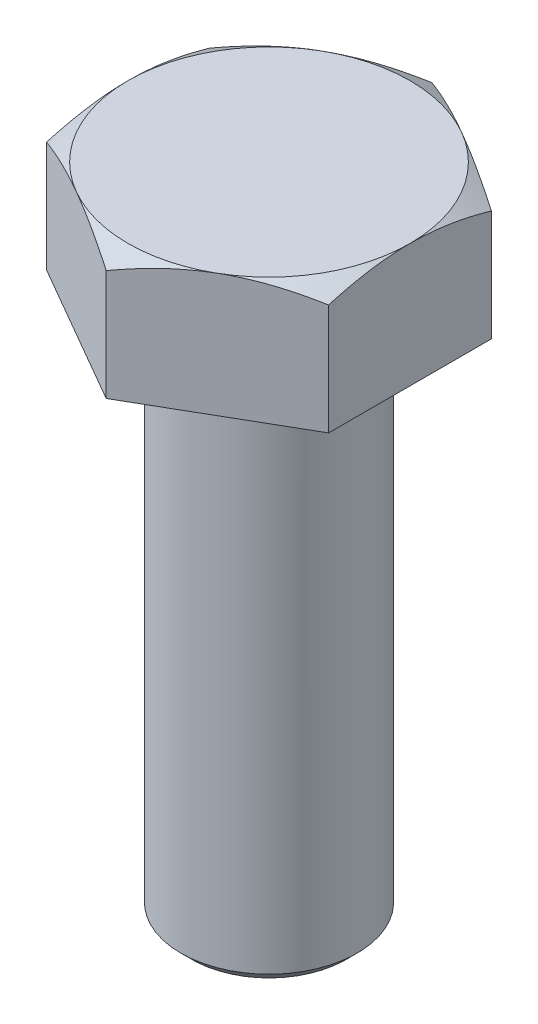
ISO-10303-21;
HEADER;
FILE_DESCRIPTION(('STEP AP214'),'2;1');
FILE_NAME('part.step','',(''),(''),'','','');
FILE_SCHEMA(('AUTOMOTIVE_DESIGN { 1 0 10303 214 1 1 1 1 }'));
ENDSEC;
DATA;
#1=APPLICATION_CONTEXT('core data for automotive mechanical design processes');
#2=APPLICATION_PROTOCOL_DEFINITION('international standard','automotive_design',2000,#1);
#3=PRODUCT_CONTEXT('',#1,'mechanical');
#4=PRODUCT('Part','Part','',(#3));
#5=PRODUCT_RELATED_PRODUCT_CATEGORY('part','',(#4));
#6=PRODUCT_DEFINITION_FORMATION('','',#4);
#7=PRODUCT_DEFINITION_CONTEXT('part definition',#1,'design');
#8=PRODUCT_DEFINITION('design','',#6,#7);
#9=PRODUCT_DEFINITION_SHAPE('','',#8);
#10=(LENGTH_UNIT() NAMED_UNIT(*) SI_UNIT(.MILLI.,.METRE.));
#11=(NAMED_UNIT(*) PLANE_ANGLE_UNIT() SI_UNIT($,.RADIAN.));
#12=(NAMED_UNIT(*) SI_UNIT($,.STERADIAN.) SOLID_ANGLE_UNIT());
#13=UNCERTAINTY_MEASURE_WITH_UNIT(LENGTH_MEASURE(1.E-05),#10,'distance_accuracy_value','');
#14=(GEOMETRIC_REPRESENTATION_CONTEXT(3) GLOBAL_UNCERTAINTY_ASSIGNED_CONTEXT((#13)) GLOBAL_UNIT_ASSIGNED_CONTEXT((#10,
#11,#12)) REPRESENTATION_CONTEXT('',''));
#15=CARTESIAN_POINT('',(0.,0.,0.));
#16=DIRECTION('',(0.,0.,1.));
#17=DIRECTION('',(1.,0.,0.));
#18=AXIS2_PLACEMENT_3D('',#15,#16,#17);
#19=CARTESIAN_POINT('',(0.,-30.,0.));
#20=DIRECTION('',(0.,1.,0.));
#21=DIRECTION('',(0.,0.,1.));
#22=AXIS2_PLACEMENT_3D('',#19,#20,#21);
#23=CYLINDRICAL_SURFACE('',#22,5.);
#24=CARTESIAN_POINT('',(0.,0.,0.));
#25=DIRECTION('',(0.,1.,0.));
#26=DIRECTION('',(0.,0.,1.));
#27=AXIS2_PLACEMENT_3D('',#24,#25,#26);
#28=CIRCLE('',#27,5.);
#29=CARTESIAN_POINT('',(0.,0.,5.));
#30=VERTEX_POINT('',#29);
#31=EDGE_CURVE('E258',#30,#30,#28,.F.);
#32=ORIENTED_EDGE('',*,*,#31,.T.);
#33=EDGE_LOOP('',(#32));
#34=FACE_BOUND('',#33,.T.);
#35=CARTESIAN_POINT('',(0.,-29.375,0.));
#36=DIRECTION('',(0.,1.,0.));
#37=DIRECTION('',(0.,0.,1.));
#38=AXIS2_PLACEMENT_3D('',#35,#36,#37);
#39=CIRCLE('',#38,5.);
#40=CARTESIAN_POINT('',(0.,-29.375,5.));
#41=VERTEX_POINT('',#40);
#42=EDGE_CURVE('E348',#41,#41,#39,.F.);
#43=ORIENTED_EDGE('',*,*,#42,.F.);
#44=EDGE_LOOP('',(#43));
#45=FACE_BOUND('',#44,.T.);
#46=ADVANCED_FACE('F50',(#34,#45),#23,.T.);
#47=CARTESIAN_POINT('',(8.,7.,-4.61880215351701));
#48=DIRECTION('',(-0.5,0.,0.866025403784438));
#49=DIRECTION('',(0.866025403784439,0.,0.5));
#50=AXIS2_PLACEMENT_3D('',#47,#48,#49);
#51=PLANE('',#50);
#52=CARTESIAN_POINT('',(8.0002,6.28540215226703,-4.61868668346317));
#53=CARTESIAN_POINT('',(7.8243512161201,6.3440092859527,-4.7202130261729));
#54=CARTESIAN_POINT('',(7.64784680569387,6.39995659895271,-4.82211789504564));
#55=CARTESIAN_POINT('',(7.29340453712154,6.50579899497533,-5.02675523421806));
#56=CARTESIAN_POINT('',(7.11546609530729,6.55569146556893,-5.1294880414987));
#57=CARTESIAN_POINT('',(6.57880176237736,6.69530720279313,-5.43933133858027));
#58=CARTESIAN_POINT('',(6.21795741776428,6.77471882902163,-5.64766491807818));
#59=CARTESIAN_POINT('',(5.67796082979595,6.86783835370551,-5.95943209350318));
#60=CARTESIAN_POINT('',(5.50042181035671,6.89436541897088,-6.06193429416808));
#61=CARTESIAN_POINT('',(5.1445408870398,6.93884682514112,-6.26740224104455));
#62=CARTESIAN_POINT('',(4.96619905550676,6.95680192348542,-6.37036794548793));
#63=CARTESIAN_POINT('',(4.6092083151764,6.98368435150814,-6.57647664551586));
#64=CARTESIAN_POINT('',(4.4305599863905,6.99262192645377,-6.67961930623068));
#65=CARTESIAN_POINT('',(4.07309829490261,7.00127769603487,-6.88599991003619));
#66=CARTESIAN_POINT('',(3.89428493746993,7.00099617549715,-6.98923785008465));
#67=CARTESIAN_POINT('',(3.55998663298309,6.99185497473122,-7.18224506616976));
#68=CARTESIAN_POINT('',(3.40447809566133,6.98411039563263,-7.27202796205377));
#69=CARTESIAN_POINT('',(3.09382523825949,6.96179886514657,-7.45138347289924));
#70=CARTESIAN_POINT('',(2.93868094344,6.94723145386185,-7.54095607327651));
#71=CARTESIAN_POINT('',(2.47384868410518,6.89363930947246,-7.80932710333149));
#72=CARTESIAN_POINT('',(2.16498351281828,6.84473135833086,-7.98765049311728));
#73=CARTESIAN_POINT('',(1.5439767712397,6.72246059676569,-8.34618890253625));
#74=CARTESIAN_POINT('',(1.23191445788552,6.648579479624,-8.52635816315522));
#75=CARTESIAN_POINT('',(0.612443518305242,6.48089985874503,-8.88400987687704));
#76=CARTESIAN_POINT('',(0.30502695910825,6.38714073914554,-9.06149691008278));
#77=CARTESIAN_POINT('',(-0.000199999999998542,6.28540215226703,-9.23771977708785));
#78=B_SPLINE_CURVE_WITH_KNOTS('',3,(#52,#53,#54,#55,#56,#57,#58,#59,#60,#61,#62,#63,#64,#65,#66,
#67,#68,#69,#70,#71,#72,#73,#74,#75,#76,#77),.UNSPECIFIED.,.F.,.F.,(4,2,2,2,2,2,2,2,2,2,2,2,4),
(0.,0.633973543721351,1.26821965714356,2.53934712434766,3.15934343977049,3.77928496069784,
4.39852133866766,5.01773858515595,5.55680239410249,6.09590254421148,7.17487077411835,
8.27776850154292,9.37850115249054),.UNSPECIFIED.);
#79=CARTESIAN_POINT('',(8.,6.28546882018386,-4.61880215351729));
#80=VERTEX_POINT('',#79);
#81=CARTESIAN_POINT('',(4.,7.,-6.92820323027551));
#82=VERTEX_POINT('',#81);
#83=EDGE_CURVE('E121',#80,#82,#78,.T.);
#84=ORIENTED_EDGE('',*,*,#83,.F.);
#85=DIRECTION('',(0.,-1.,0.));
#86=VECTOR('',#85,1.);
#87=CARTESIAN_POINT('',(8.,7.,-4.61880215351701));
#88=LINE('',#87,#86);
#89=CARTESIAN_POINT('',(8.,0.,-4.61880215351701));
#90=VERTEX_POINT('',#89);
#91=EDGE_CURVE('E253',#80,#90,#88,.T.);
#92=ORIENTED_EDGE('',*,*,#91,.T.);
#93=DIRECTION('',(-0.866025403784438,0.,-0.5));
#94=VECTOR('',#93,1.);
#95=CARTESIAN_POINT('',(8.,0.,-4.61880215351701));
#96=LINE('',#95,#94);
#97=CARTESIAN_POINT('',(0.,0.,-9.23760430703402));
#98=VERTEX_POINT('',#97);
#99=EDGE_CURVE('E129',#90,#98,#96,.T.);
#100=ORIENTED_EDGE('',*,*,#99,.T.);
#101=DIRECTION('',(0.,-1.,0.));
#102=VECTOR('',#101,1.);
#103=CARTESIAN_POINT('',(0.,7.,-9.23760430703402));
#104=LINE('',#103,#102);
#105=CARTESIAN_POINT('',(0.,6.28546882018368,-9.23760430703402));
#106=VERTEX_POINT('',#105);
#107=EDGE_CURVE('E144',#106,#98,#104,.T.);
#108=ORIENTED_EDGE('',*,*,#107,.F.);
#109=EDGE_CURVE('E130',#82,#106,#78,.T.);
#110=ORIENTED_EDGE('',*,*,#109,.F.);
#111=EDGE_LOOP('',(#84,#92,#100,#108,#110));
#112=FACE_BOUND('',#111,.T.);
#113=ADVANCED_FACE('F52',(#112),#51,.F.);
#114=CARTESIAN_POINT('',(0.,7.,-9.23760430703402));
#115=DIRECTION('',(0.5,0.,0.866025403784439));
#116=DIRECTION('',(0.866025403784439,0.,-0.5));
#117=AXIS2_PLACEMENT_3D('',#114,#115,#116);
#118=PLANE('',#117);
#119=CARTESIAN_POINT('',(0.000200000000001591,6.28540215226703,-9.23771977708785));
#120=CARTESIAN_POINT('',(-0.175648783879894,6.3440092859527,-9.13619343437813));
#121=CARTESIAN_POINT('',(-0.352153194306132,6.39995659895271,-9.03428856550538));
#122=CARTESIAN_POINT('',(-0.706595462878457,6.50579899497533,-8.82965122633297));
#123=CARTESIAN_POINT('',(-0.884533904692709,6.55569146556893,-8.72691841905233));
#124=CARTESIAN_POINT('',(-1.42119823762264,6.69530720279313,-8.41707512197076));
#125=CARTESIAN_POINT('',(-1.78204258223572,6.77471882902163,-8.20874154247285));
#126=CARTESIAN_POINT('',(-2.32203917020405,6.86783835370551,-7.89697436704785));
#127=CARTESIAN_POINT('',(-2.49957818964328,6.89436541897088,-7.79447216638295));
#128=CARTESIAN_POINT('',(-2.8554591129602,6.93884682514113,-7.58900421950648));
#129=CARTESIAN_POINT('',(-3.03380094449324,6.95680192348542,-7.4860385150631));
#130=CARTESIAN_POINT('',(-3.3907916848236,6.98368435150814,-7.27992981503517));
#131=CARTESIAN_POINT('',(-3.5694400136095,6.99262192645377,-7.17678715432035));
#132=CARTESIAN_POINT('',(-3.92690170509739,7.00127769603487,-6.97040655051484));
#133=CARTESIAN_POINT('',(-4.10571506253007,7.00099617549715,-6.86716861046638));
#134=CARTESIAN_POINT('',(-4.44001336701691,6.99185497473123,-6.67416139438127));
#135=CARTESIAN_POINT('',(-4.59552190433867,6.98411039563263,-6.58437849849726));
#136=CARTESIAN_POINT('',(-4.90617476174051,6.96179886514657,-6.40502298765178));
#137=CARTESIAN_POINT('',(-5.06131905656,6.94723145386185,-6.31545038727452));
#138=CARTESIAN_POINT('',(-5.52615131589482,6.89363930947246,-6.04707935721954));
#139=CARTESIAN_POINT('',(-5.83501648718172,6.84473135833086,-5.86875596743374));
#140=CARTESIAN_POINT('',(-6.4560232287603,6.72246059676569,-5.51021755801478));
#141=CARTESIAN_POINT('',(-6.76808554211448,6.648579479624,-5.33004829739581));
#142=CARTESIAN_POINT('',(-7.38755648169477,6.48089985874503,-4.97239658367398));
#143=CARTESIAN_POINT('',(-7.69497304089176,6.38714073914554,-4.79490955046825));
#144=CARTESIAN_POINT('',(-8.00020000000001,6.28540215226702,-4.61868668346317));
#145=B_SPLINE_CURVE_WITH_KNOTS('',3,(#119,#120,#121,#122,#123,#124,#125,#126,#127,#128,#129,
#130,#131,#132,#133,#134,#135,#136,#137,#138,#139,#140,#141,#142,#143,#144),.UNSPECIFIED.,.F.,
.F.,(4,2,2,2,2,2,2,2,2,2,2,2,4),(0.,0.633973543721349,1.26821965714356,2.53934712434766,
3.15934343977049,3.77928496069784,4.39852133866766,5.01773858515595,5.55680239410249,
6.09590254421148,7.17487077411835,8.27776850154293,9.37850115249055),.UNSPECIFIED.);
#146=CARTESIAN_POINT('',(-4.,7.,-6.92820323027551));
#147=VERTEX_POINT('',#146);
#148=EDGE_CURVE('E136',#106,#147,#145,.T.);
#149=ORIENTED_EDGE('',*,*,#148,.F.);
#150=ORIENTED_EDGE('',*,*,#107,.T.);
#151=DIRECTION('',(-0.866025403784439,0.,0.5));
#152=VECTOR('',#151,1.);
#153=CARTESIAN_POINT('',(0.,0.,-9.23760430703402));
#154=LINE('',#153,#152);
#155=CARTESIAN_POINT('',(-8.00000000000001,0.,-4.61880215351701));
#156=VERTEX_POINT('',#155);
#157=EDGE_CURVE('E293',#98,#156,#154,.T.);
#158=ORIENTED_EDGE('',*,*,#157,.T.);
#159=DIRECTION('',(0.,-1.,0.));
#160=VECTOR('',#159,1.);
#161=CARTESIAN_POINT('',(-8.00000000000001,7.,-4.61880215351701));
#162=LINE('',#161,#160);
#163=CARTESIAN_POINT('',(-8.00000000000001,6.28546882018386,-4.61880215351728));
#164=VERTEX_POINT('',#163);
#165=EDGE_CURVE('E251',#164,#156,#162,.T.);
#166=ORIENTED_EDGE('',*,*,#165,.F.);
#167=EDGE_CURVE('E145',#147,#164,#145,.T.);
#168=ORIENTED_EDGE('',*,*,#167,.F.);
#169=EDGE_LOOP('',(#149,#150,#158,#166,#168));
#170=FACE_BOUND('',#169,.T.);
#171=ADVANCED_FACE('F199',(#170),#118,.F.);
#172=CARTESIAN_POINT('',(-8.00000000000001,7.,-4.61880215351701));
#173=DIRECTION('',(1.,0.,0.));
#174=DIRECTION('',(0.,0.,-1.));
#175=AXIS2_PLACEMENT_3D('',#172,#173,#174);
#176=PLANE('',#175);
#177=CARTESIAN_POINT('',(-8.00000000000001,2.98210147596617,-12.6403241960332));
#178=CARTESIAN_POINT('',(-8.00000000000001,3.15352784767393,-12.288843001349));
#179=CARTESIAN_POINT('',(-8.00000000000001,3.32337660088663,-11.9365795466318));
#180=CARTESIAN_POINT('',(-8.00000000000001,3.6590358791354,-11.2300728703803));
#181=CARTESIAN_POINT('',(-8.00000000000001,3.82484581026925,-10.8758293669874));
#182=CARTESIAN_POINT('',(-8.00000000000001,4.15232914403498,-10.1632322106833));
#183=CARTESIAN_POINT('',(-8.00000000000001,4.3139770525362,-9.8048668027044));
#184=CARTESIAN_POINT('',(-8.00000000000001,4.63096142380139,-9.08536584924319));
#185=CARTESIAN_POINT('',(-8.00000000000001,4.78629817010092,-8.72423042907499));
#186=CARTESIAN_POINT('',(-8.00000000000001,5.09418856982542,-7.98618087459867));
#187=CARTESIAN_POINT('',(-8.00000000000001,5.2464643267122,-7.60915019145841));
#188=CARTESIAN_POINT('',(-8.00000000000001,5.54004662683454,-6.85076602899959));
#189=CARTESIAN_POINT('',(-8.00000000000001,5.68135197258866,-6.46941208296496));
#190=CARTESIAN_POINT('',(-8.00000000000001,5.94945436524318,-5.70241102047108));
#191=CARTESIAN_POINT('',(-8.00000000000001,6.07627885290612,-5.31677359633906));
#192=CARTESIAN_POINT('',(-8.00000000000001,6.31150673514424,-4.53998544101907));
#193=CARTESIAN_POINT('',(-8.00000000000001,6.41991568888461,-4.1488364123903));
#194=CARTESIAN_POINT('',(-8.00000000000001,6.6126837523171,-3.36291309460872));
#195=CARTESIAN_POINT('',(-8.00000000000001,6.69717902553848,-2.96817310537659));
#196=CARTESIAN_POINT('',(-8.00000000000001,6.80244314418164,-2.372289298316));
#197=CARTESIAN_POINT('',(-8.00000000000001,6.83395269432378,-2.17301971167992));
#198=CARTESIAN_POINT('',(-8.00000000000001,6.88920069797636,-1.77341268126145));
#199=CARTESIAN_POINT('',(-8.00000000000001,6.91293990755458,-1.57307534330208));
#200=CARTESIAN_POINT('',(-8.00000000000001,6.95186378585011,-1.1743200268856));
#201=CARTESIAN_POINT('',(-8.00000000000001,6.96716047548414,-0.975913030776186));
#202=CARTESIAN_POINT('',(-8.00000000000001,6.98934114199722,-0.578629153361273));
#203=CARTESIAN_POINT('',(-8.00000000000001,6.99622526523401,-0.379752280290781));
#204=CARTESIAN_POINT('',(-8.00000000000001,7.0014154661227,0.018116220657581));
#205=CARTESIAN_POINT('',(-8.,6.99972150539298,0.217107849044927));
#206=CARTESIAN_POINT('',(-8.,6.98779932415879,0.614837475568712));
#207=CARTESIAN_POINT('',(-8.,6.97757072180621,0.813575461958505));
#208=CARTESIAN_POINT('',(-8.,6.94346280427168,1.28422959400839));
#209=CARTESIAN_POINT('',(-8.,6.91592258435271,1.55588667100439));
#210=CARTESIAN_POINT('',(-8.,6.84634635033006,2.0973230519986));
#211=CARTESIAN_POINT('',(-8.,6.80430856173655,2.36710212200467));
#212=CARTESIAN_POINT('',(-8.,6.65866676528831,3.17322847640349));
#213=CARTESIAN_POINT('',(-8.,6.53555570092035,3.70610589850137));
#214=CARTESIAN_POINT('',(-8.,6.32026611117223,4.50338683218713));
#215=CARTESIAN_POINT('',(-8.,6.24232167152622,4.77187301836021));
#216=CARTESIAN_POINT('',(-8.,6.0778896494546,5.30624232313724));
#217=CARTESIAN_POINT('',(-8.,5.99140199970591,5.57212542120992));
#218=CARTESIAN_POINT('',(-8.,5.8113080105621,6.10136688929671));
#219=CARTESIAN_POINT('',(-8.,5.71770360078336,6.36472592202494));
#220=CARTESIAN_POINT('',(-8.,5.52452196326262,6.88922947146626));
#221=CARTESIAN_POINT('',(-8.,5.42494488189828,7.15037404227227));
#222=CARTESIAN_POINT('',(-8.,5.14514476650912,7.86355537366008));
#223=CARTESIAN_POINT('',(-8.,4.95985624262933,8.31360309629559));
#224=CARTESIAN_POINT('',(-8.,4.5781123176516,9.2089554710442));
#225=CARTESIAN_POINT('',(-8.,4.38165558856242,9.65425955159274));
#226=CARTESIAN_POINT('',(-8.,3.98026324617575,10.5412363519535));
#227=CARTESIAN_POINT('',(-8.,3.7753241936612,10.9829075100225));
#228=CARTESIAN_POINT('',(-8.,3.35903186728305,11.8631821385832));
#229=CARTESIAN_POINT('',(-8.,3.1476788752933,12.3017857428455));
#230=CARTESIAN_POINT('',(-8.,2.71961681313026,13.1772814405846));
#231=CARTESIAN_POINT('',(-8.,2.50289932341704,13.6141694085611));
#232=CARTESIAN_POINT('',(-8.,2.06550352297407,14.4859595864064));
#233=CARTESIAN_POINT('',(-8.,1.84482517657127,14.9208617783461));
#234=CARTESIAN_POINT('',(-8.,1.40034905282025,15.7889376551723));
#235=CARTESIAN_POINT('',(-8.,1.1765520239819,16.2221117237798));
#236=CARTESIAN_POINT('',(-8.,0.72637922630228,17.0871185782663));
#237=CARTESIAN_POINT('',(-8.,0.500003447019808,17.5189513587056));
#238=CARTESIAN_POINT('',(-8.,-0.132898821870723,18.71912958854));
#239=CARTESIAN_POINT('',(-8.,-0.541721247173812,19.4862640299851));
#240=CARTESIAN_POINT('',(-8.,-1.36422301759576,21.0179839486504));
#241=CARTESIAN_POINT('',(-8.,-1.7779026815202,21.782569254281));
#242=CARTESIAN_POINT('',(-8.,-2.60742602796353,23.3071112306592));
#243=CARTESIAN_POINT('',(-8.,-3.0232571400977,24.0670747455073));
#244=CARTESIAN_POINT('',(-8.,-3.6490471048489,25.2058550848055));
#245=CARTESIAN_POINT('',(-8.,-3.85797568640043,25.5852388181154));
#246=CARTESIAN_POINT('',(-8.,-4.27644296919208,26.3436690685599));
#247=CARTESIAN_POINT('',(-8.,-4.48598166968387,26.7227155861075));
#248=CARTESIAN_POINT('',(-8.,-4.69578739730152,27.1016142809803));
#249=B_SPLINE_CURVE_WITH_KNOTS('',3,(#177,#178,#179,#180,#181,#182,#183,#184,#185,#186,#187,
#188,#189,#190,#191,#192,#193,#194,#195,#196,#197,#198,#199,#200,#201,#202,#203,#204,#205,#206,
#207,#208,#209,#210,#211,#212,#213,#214,#215,#216,#217,#218,#219,#220,#221,#222,#223,#224,#225,
#226,#227,#228,#229,#230,#231,#232,#233,#234,#235,#236,#237,#238,#239,#240,#241,#242,#243,#244,
#245,#246,#247,#248),.UNSPECIFIED.,.F.,.F.,(4,2,2,2,2,2,2,2,2,2,2,2,2,2,2,2,2,2,2,2,2,2,2,2,2,2,
2,2,2,2,2,2,2,2,2,4),(0.,1.17318598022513,2.3465434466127,3.52590216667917,4.70520784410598,
5.92493599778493,7.14479710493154,8.36230684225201,9.57944838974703,10.789513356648,
11.3946221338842,11.9996720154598,12.5964878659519,13.1932933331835,13.7901014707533,
14.3869363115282,15.2056272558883,16.0244184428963,17.6627769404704,18.5014144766,
19.3400586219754,20.1784761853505,21.0168732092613,22.4767387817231,23.9367783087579,
25.3974157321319,26.8579890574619,28.3210217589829,29.7840676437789,31.2467682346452,
32.7094747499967,35.3172586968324,37.9252147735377,40.524079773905,41.8234055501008,
43.1227297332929),.UNSPECIFIED.);
#250=CARTESIAN_POINT('',(-8.,7.,0.));
#251=VERTEX_POINT('',#250);
#252=EDGE_CURVE('E193',#164,#251,#249,.T.);
#253=ORIENTED_EDGE('',*,*,#252,.F.);
#254=ORIENTED_EDGE('',*,*,#165,.T.);
#255=DIRECTION('',(0.,0.,1.));
#256=VECTOR('',#255,1.);
#257=CARTESIAN_POINT('',(-8.00000000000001,0.,-4.61880215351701));
#258=LINE('',#257,#256);
#259=CARTESIAN_POINT('',(-8.,0.,4.61880215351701));
#260=VERTEX_POINT('',#259);
#261=EDGE_CURVE('E292',#156,#260,#258,.T.);
#262=ORIENTED_EDGE('',*,*,#261,.T.);
#263=DIRECTION('',(0.,-1.,0.));
#264=VECTOR('',#263,1.);
#265=CARTESIAN_POINT('',(-8.,7.,4.61880215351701));
#266=LINE('',#265,#264);
#267=CARTESIAN_POINT('',(-8.,6.28546882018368,4.61880215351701));
#268=VERTEX_POINT('',#267);
#269=EDGE_CURVE('E248',#268,#260,#266,.T.);
#270=ORIENTED_EDGE('',*,*,#269,.F.);
#271=EDGE_CURVE('E188',#251,#268,#249,.T.);
#272=ORIENTED_EDGE('',*,*,#271,.F.);
#273=EDGE_LOOP('',(#253,#254,#262,#270,#272));
#274=FACE_BOUND('',#273,.T.);
#275=ADVANCED_FACE('F195',(#274),#176,.F.);
#276=CARTESIAN_POINT('',(-8.,7.,4.61880215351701));
#277=DIRECTION('',(0.5,0.,-0.866025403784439));
#278=DIRECTION('',(-0.866025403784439,0.,-0.5));
#279=AXIS2_PLACEMENT_3D('',#276,#277,#278);
#280=PLANE('',#279);
#281=CARTESIAN_POINT('',(-8.0002,6.28540215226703,4.61868668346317));
#282=CARTESIAN_POINT('',(-7.82435121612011,6.3440092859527,4.7202130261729));
#283=CARTESIAN_POINT('',(-7.64784680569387,6.39995659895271,4.82211789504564));
#284=CARTESIAN_POINT('',(-7.29340453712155,6.50579899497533,5.02675523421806));
#285=CARTESIAN_POINT('',(-7.11546609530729,6.55569146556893,5.1294880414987));
#286=CARTESIAN_POINT('',(-6.57880176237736,6.69530720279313,5.43933133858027));
#287=CARTESIAN_POINT('',(-6.21795741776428,6.77471882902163,5.64766491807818));
#288=CARTESIAN_POINT('',(-5.67796082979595,6.86783835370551,5.95943209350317));
#289=CARTESIAN_POINT('',(-5.50042181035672,6.89436541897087,6.06193429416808));
#290=CARTESIAN_POINT('',(-5.1445408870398,6.93884682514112,6.26740224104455));
#291=CARTESIAN_POINT('',(-4.96619905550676,6.95680192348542,6.37036794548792));
#292=CARTESIAN_POINT('',(-4.60920831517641,6.98368435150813,6.57647664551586));
#293=CARTESIAN_POINT('',(-4.4305599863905,6.99262192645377,6.67961930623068));
#294=CARTESIAN_POINT('',(-4.07309829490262,7.00127769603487,6.88599991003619));
#295=CARTESIAN_POINT('',(-3.89428493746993,7.00099617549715,6.98923785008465));
#296=CARTESIAN_POINT('',(-3.5599866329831,6.99185497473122,7.18224506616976));
#297=CARTESIAN_POINT('',(-3.40447809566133,6.98411039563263,7.27202796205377));
#298=CARTESIAN_POINT('',(-3.09382523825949,6.96179886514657,7.45138347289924));
#299=CARTESIAN_POINT('',(-2.93868094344,6.94723145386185,7.54095607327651));
#300=CARTESIAN_POINT('',(-2.47384868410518,6.89363930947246,7.80932710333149));
#301=CARTESIAN_POINT('',(-2.16498351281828,6.84473135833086,7.98765049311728));
#302=CARTESIAN_POINT('',(-1.5439767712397,6.72246059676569,8.34618890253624));
#303=CARTESIAN_POINT('',(-1.23191445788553,6.648579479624,8.52635816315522));
#304=CARTESIAN_POINT('',(-0.612443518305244,6.48089985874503,8.88400987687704));
#305=CARTESIAN_POINT('',(-0.305026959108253,6.38714073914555,9.06149691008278));
#306=CARTESIAN_POINT('',(0.000199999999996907,6.28540215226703,9.23771977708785));
#307=B_SPLINE_CURVE_WITH_KNOTS('',3,(#281,#282,#283,#284,#285,#286,#287,#288,#289,#290,#291,
#292,#293,#294,#295,#296,#297,#298,#299,#300,#301,#302,#303,#304,#305,#306),.UNSPECIFIED.,.F.,
.F.,(4,2,2,2,2,2,2,2,2,2,2,2,4),(0.,0.63397354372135,1.26821965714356,2.53934712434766,
3.15934343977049,3.77928496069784,4.39852133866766,5.01773858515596,5.55680239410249,
6.09590254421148,7.17487077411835,8.27776850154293,9.37850115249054),.UNSPECIFIED.);
#308=CARTESIAN_POINT('',(-4.,7.,6.92820323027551));
#309=VERTEX_POINT('',#308);
#310=EDGE_CURVE('E194',#268,#309,#307,.T.);
#311=ORIENTED_EDGE('',*,*,#310,.F.);
#312=ORIENTED_EDGE('',*,*,#269,.T.);
#313=DIRECTION('',(0.866025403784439,0.,0.5));
#314=VECTOR('',#313,1.);
#315=CARTESIAN_POINT('',(-8.,0.,4.61880215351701));
#316=LINE('',#315,#314);
#317=CARTESIAN_POINT('',(0.,0.,9.23760430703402));
#318=VERTEX_POINT('',#317);
#319=EDGE_CURVE('E246',#260,#318,#316,.T.);
#320=ORIENTED_EDGE('',*,*,#319,.T.);
#321=DIRECTION('',(0.,-1.,0.));
#322=VECTOR('',#321,1.);
#323=CARTESIAN_POINT('',(0.,7.,9.23760430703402));
#324=LINE('',#323,#322);
#325=CARTESIAN_POINT('',(0.,6.28546882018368,9.23760430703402));
#326=VERTEX_POINT('',#325);
#327=EDGE_CURVE('E238',#326,#318,#324,.T.);
#328=ORIENTED_EDGE('',*,*,#327,.F.);
#329=EDGE_CURVE('E183',#309,#326,#307,.T.);
#330=ORIENTED_EDGE('',*,*,#329,.F.);
#331=EDGE_LOOP('',(#311,#312,#320,#328,#330));
#332=FACE_BOUND('',#331,.T.);
#333=ADVANCED_FACE('F198',(#332),#280,.F.);
#334=CARTESIAN_POINT('',(0.,7.,9.23760430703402));
#335=DIRECTION('',(-0.5,0.,-0.866025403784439));
#336=DIRECTION('',(-0.866025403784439,0.,0.5));
#337=AXIS2_PLACEMENT_3D('',#334,#335,#336);
#338=PLANE('',#337);
#339=CARTESIAN_POINT('',(-0.000200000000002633,6.28540215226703,9.23771977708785));
#340=CARTESIAN_POINT('',(0.175648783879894,6.3440092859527,9.13619343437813));
#341=CARTESIAN_POINT('',(0.352153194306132,6.39995659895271,9.03428856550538));
#342=CARTESIAN_POINT('',(0.706595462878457,6.50579899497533,8.82965122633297));
#343=CARTESIAN_POINT('',(0.884533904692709,6.55569146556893,8.72691841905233));
#344=CARTESIAN_POINT('',(1.42119823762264,6.69530720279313,8.41707512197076));
#345=CARTESIAN_POINT('',(1.78204258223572,6.77471882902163,8.20874154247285));
#346=CARTESIAN_POINT('',(2.32203917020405,6.86783835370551,7.89697436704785));
#347=CARTESIAN_POINT('',(2.49957818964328,6.89436541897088,7.79447216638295));
#348=CARTESIAN_POINT('',(2.8554591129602,6.93884682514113,7.58900421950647));
#349=CARTESIAN_POINT('',(3.03380094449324,6.95680192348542,7.4860385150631));
#350=CARTESIAN_POINT('',(3.39079168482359,6.98368435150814,7.27992981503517));
#351=CARTESIAN_POINT('',(3.5694400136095,6.99262192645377,7.17678715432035));
#352=CARTESIAN_POINT('',(3.92690170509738,7.00127769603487,6.97040655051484));
#353=CARTESIAN_POINT('',(4.10571506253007,7.00099617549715,6.86716861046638));
#354=CARTESIAN_POINT('',(4.44001336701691,6.99185497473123,6.67416139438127));
#355=CARTESIAN_POINT('',(4.59552190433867,6.98411039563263,6.58437849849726));
#356=CARTESIAN_POINT('',(4.90617476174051,6.96179886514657,6.40502298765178));
#357=CARTESIAN_POINT('',(5.06131905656,6.94723145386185,6.31545038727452));
#358=CARTESIAN_POINT('',(5.52615131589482,6.89363930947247,6.04707935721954));
#359=CARTESIAN_POINT('',(5.83501648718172,6.84473135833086,5.86875596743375));
#360=CARTESIAN_POINT('',(6.4560232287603,6.72246059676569,5.51021755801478));
#361=CARTESIAN_POINT('',(6.76808554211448,6.648579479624,5.33004829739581));
#362=CARTESIAN_POINT('',(7.38755648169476,6.48089985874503,4.97239658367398));
#363=CARTESIAN_POINT('',(7.69497304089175,6.38714073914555,4.79490955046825));
#364=CARTESIAN_POINT('',(8.0002,6.28540215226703,4.61868668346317));
#365=B_SPLINE_CURVE_WITH_KNOTS('',3,(#339,#340,#341,#342,#343,#344,#345,#346,#347,#348,#349,
#350,#351,#352,#353,#354,#355,#356,#357,#358,#359,#360,#361,#362,#363,#364),.UNSPECIFIED.,.F.,
.F.,(4,2,2,2,2,2,2,2,2,2,2,2,4),(0.,0.633973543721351,1.26821965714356,2.53934712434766,
3.15934343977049,3.77928496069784,4.39852133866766,5.01773858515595,5.55680239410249,
6.09590254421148,7.17487077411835,8.27776850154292,9.37850115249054),.UNSPECIFIED.);
#366=CARTESIAN_POINT('',(4.,7.,6.92820323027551));
#367=VERTEX_POINT('',#366);
#368=EDGE_CURVE('E235',#326,#367,#365,.T.);
#369=ORIENTED_EDGE('',*,*,#368,.F.);
#370=ORIENTED_EDGE('',*,*,#327,.T.);
#371=DIRECTION('',(0.866025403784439,0.,-0.5));
#372=VECTOR('',#371,1.);
#373=CARTESIAN_POINT('',(0.,0.,9.23760430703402));
#374=LINE('',#373,#372);
#375=CARTESIAN_POINT('',(8.,0.,4.61880215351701));
#376=VERTEX_POINT('',#375);
#377=EDGE_CURVE('E282',#318,#376,#374,.T.);
#378=ORIENTED_EDGE('',*,*,#377,.T.);
#379=DIRECTION('',(0.,-1.,0.));
#380=VECTOR('',#379,1.);
#381=CARTESIAN_POINT('',(8.,7.,4.61880215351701));
#382=LINE('',#381,#380);
#383=CARTESIAN_POINT('',(8.,6.28546882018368,4.61880215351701));
#384=VERTEX_POINT('',#383);
#385=EDGE_CURVE('E249',#384,#376,#382,.T.);
#386=ORIENTED_EDGE('',*,*,#385,.F.);
#387=EDGE_CURVE('E177',#367,#384,#365,.T.);
#388=ORIENTED_EDGE('',*,*,#387,.F.);
#389=EDGE_LOOP('',(#369,#370,#378,#386,#388));
#390=FACE_BOUND('',#389,.T.);
#391=ADVANCED_FACE('F224',(#390),#338,.F.);
#392=CARTESIAN_POINT('',(8.,7.,4.61880215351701));
#393=DIRECTION('',(-1.,0.,0.));
#394=DIRECTION('',(0.,0.,1.));
#395=AXIS2_PLACEMENT_3D('',#392,#393,#394);
#396=PLANE('',#395);
#397=CARTESIAN_POINT('',(8.,2.98210147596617,-12.6403241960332));
#398=CARTESIAN_POINT('',(8.,3.15352784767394,-12.288843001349));
#399=CARTESIAN_POINT('',(8.,3.32337660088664,-11.9365795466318));
#400=CARTESIAN_POINT('',(8.,3.6590358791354,-11.2300728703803));
#401=CARTESIAN_POINT('',(8.,3.82484581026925,-10.8758293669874));
#402=CARTESIAN_POINT('',(8.,4.15232914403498,-10.1632322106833));
#403=CARTESIAN_POINT('',(8.,4.3139770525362,-9.8048668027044));
#404=CARTESIAN_POINT('',(8.,4.63096142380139,-9.08536584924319));
#405=CARTESIAN_POINT('',(8.,4.78629817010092,-8.724230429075));
#406=CARTESIAN_POINT('',(8.,5.09418856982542,-7.98618087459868));
#407=CARTESIAN_POINT('',(8.,5.2464643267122,-7.60915019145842));
#408=CARTESIAN_POINT('',(8.,5.54004662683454,-6.8507660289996));
#409=CARTESIAN_POINT('',(8.,5.68135197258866,-6.46941208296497));
#410=CARTESIAN_POINT('',(8.,5.94945436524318,-5.70241102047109));
#411=CARTESIAN_POINT('',(8.,6.07627885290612,-5.31677359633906));
#412=CARTESIAN_POINT('',(8.,6.31150673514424,-4.53998544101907));
#413=CARTESIAN_POINT('',(8.,6.41991568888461,-4.1488364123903));
#414=CARTESIAN_POINT('',(8.,6.61268375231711,-3.36291309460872));
#415=CARTESIAN_POINT('',(8.,6.69717902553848,-2.96817310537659));
#416=CARTESIAN_POINT('',(8.,6.80244314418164,-2.372289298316));
#417=CARTESIAN_POINT('',(8.,6.83395269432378,-2.17301971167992));
#418=CARTESIAN_POINT('',(8.,6.88920069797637,-1.77341268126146));
#419=CARTESIAN_POINT('',(8.,6.91293990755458,-1.57307534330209));
#420=CARTESIAN_POINT('',(8.,6.95186378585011,-1.1743200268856));
#421=CARTESIAN_POINT('',(8.,6.96716047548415,-0.975913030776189));
#422=CARTESIAN_POINT('',(8.,6.98934114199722,-0.578629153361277));
#423=CARTESIAN_POINT('',(8.,6.99622526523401,-0.379752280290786));
#424=CARTESIAN_POINT('',(8.,7.0014154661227,0.0181162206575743));
#425=CARTESIAN_POINT('',(8.,6.99972150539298,0.21710784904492));
#426=CARTESIAN_POINT('',(8.,6.9877993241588,0.614837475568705));
#427=CARTESIAN_POINT('',(8.,6.97757072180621,0.813575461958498));
#428=CARTESIAN_POINT('',(8.,6.94346280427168,1.28422959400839));
#429=CARTESIAN_POINT('',(8.,6.91592258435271,1.55588667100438));
#430=CARTESIAN_POINT('',(8.,6.84634635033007,2.09732305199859));
#431=CARTESIAN_POINT('',(8.,6.80430856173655,2.36710212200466));
#432=CARTESIAN_POINT('',(8.,6.65866676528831,3.17322847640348));
#433=CARTESIAN_POINT('',(8.,6.53555570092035,3.70610589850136));
#434=CARTESIAN_POINT('',(8.,6.32026611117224,4.50338683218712));
#435=CARTESIAN_POINT('',(8.,6.24232167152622,4.77187301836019));
#436=CARTESIAN_POINT('',(8.,6.07788964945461,5.30624232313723));
#437=CARTESIAN_POINT('',(8.,5.99140199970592,5.57212542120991));
#438=CARTESIAN_POINT('',(8.,5.81130801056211,6.10136688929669));
#439=CARTESIAN_POINT('',(8.,5.71770360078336,6.36472592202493));
#440=CARTESIAN_POINT('',(8.,5.52452196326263,6.88922947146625));
#441=CARTESIAN_POINT('',(8.,5.42494488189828,7.15037404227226));
#442=CARTESIAN_POINT('',(8.,5.14514476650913,7.86355537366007));
#443=CARTESIAN_POINT('',(8.,4.95985624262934,8.31360309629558));
#444=CARTESIAN_POINT('',(8.,4.5781123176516,9.20895547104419));
#445=CARTESIAN_POINT('',(8.,4.38165558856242,9.65425955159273));
#446=CARTESIAN_POINT('',(8.,3.98026324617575,10.5412363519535));
#447=CARTESIAN_POINT('',(8.,3.77532419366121,10.9829075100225));
#448=CARTESIAN_POINT('',(8.,3.35903186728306,11.8631821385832));
#449=CARTESIAN_POINT('',(8.,3.14767887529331,12.3017857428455));
#450=CARTESIAN_POINT('',(8.,2.71961681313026,13.1772814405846));
#451=CARTESIAN_POINT('',(8.,2.50289932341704,13.6141694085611));
#452=CARTESIAN_POINT('',(8.,2.06550352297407,14.4859595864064));
#453=CARTESIAN_POINT('',(8.,1.84482517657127,14.9208617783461));
#454=CARTESIAN_POINT('',(8.,1.40034905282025,15.7889376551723));
#455=CARTESIAN_POINT('',(8.,1.17655202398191,16.2221117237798));
#456=CARTESIAN_POINT('',(8.,0.726379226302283,17.0871185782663));
#457=CARTESIAN_POINT('',(8.,0.500003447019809,17.5189513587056));
#458=CARTESIAN_POINT('',(8.,-0.132898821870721,18.71912958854));
#459=CARTESIAN_POINT('',(7.99999999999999,-0.541721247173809,19.4862640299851));
#460=CARTESIAN_POINT('',(7.99999999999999,-1.36422301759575,21.0179839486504));
#461=CARTESIAN_POINT('',(7.99999999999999,-1.77790268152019,21.7825692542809));
#462=CARTESIAN_POINT('',(7.99999999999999,-2.60742602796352,23.3071112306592));
#463=CARTESIAN_POINT('',(7.99999999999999,-3.02325714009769,24.0670747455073));
#464=CARTESIAN_POINT('',(7.99999999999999,-3.6490471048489,25.2058550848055));
#465=CARTESIAN_POINT('',(7.99999999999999,-3.85797568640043,25.5852388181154));
#466=CARTESIAN_POINT('',(7.99999999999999,-4.27644296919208,26.3436690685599));
#467=CARTESIAN_POINT('',(7.99999999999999,-4.48598166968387,26.7227155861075));
#468=CARTESIAN_POINT('',(7.99999999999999,-4.69578739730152,27.1016142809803));
#469=B_SPLINE_CURVE_WITH_KNOTS('',3,(#397,#398,#399,#400,#401,#402,#403,#404,#405,#406,#407,
#408,#409,#410,#411,#412,#413,#414,#415,#416,#417,#418,#419,#420,#421,#422,#423,#424,#425,#426,
#427,#428,#429,#430,#431,#432,#433,#434,#435,#436,#437,#438,#439,#440,#441,#442,#443,#444,#445,
#446,#447,#448,#449,#450,#451,#452,#453,#454,#455,#456,#457,#458,#459,#460,#461,#462,#463,#464,
#465,#466,#467,#468),.UNSPECIFIED.,.F.,.F.,(4,2,2,2,2,2,2,2,2,2,2,2,2,2,2,2,2,2,2,2,2,2,2,2,2,2,
2,2,2,2,2,2,2,2,2,4),(0.,1.17318598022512,2.34654344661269,3.52590216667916,4.70520784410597,
5.92493599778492,7.14479710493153,8.36230684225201,9.57944838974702,10.789513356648,
11.3946221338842,11.9996720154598,12.5964878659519,13.1932933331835,13.7901014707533,
14.3869363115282,15.2056272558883,16.0244184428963,17.6627769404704,18.5014144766,
19.3400586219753,20.1784761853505,21.0168732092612,22.4767387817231,23.9367783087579,
25.3974157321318,26.8579890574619,28.3210217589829,29.7840676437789,31.2467682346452,
32.7094747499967,35.3172586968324,37.9252147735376,40.524079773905,41.8234055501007,
43.1227297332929),.UNSPECIFIED.);
#470=CARTESIAN_POINT('',(8.,7.,0.));
#471=VERTEX_POINT('',#470);
#472=EDGE_CURVE('E280',#384,#471,#469,.F.);
#473=ORIENTED_EDGE('',*,*,#472,.F.);
#474=ORIENTED_EDGE('',*,*,#385,.T.);
#475=DIRECTION('',(0.,0.,-1.));
#476=VECTOR('',#475,1.);
#477=CARTESIAN_POINT('',(8.,0.,4.61880215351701));
#478=LINE('',#477,#476);
#479=EDGE_CURVE('E285',#376,#90,#478,.T.);
#480=ORIENTED_EDGE('',*,*,#479,.T.);
#481=ORIENTED_EDGE('',*,*,#91,.F.);
#482=EDGE_CURVE('E125',#471,#80,#469,.F.);
#483=ORIENTED_EDGE('',*,*,#482,.F.);
#484=EDGE_LOOP('',(#473,#474,#480,#481,#483));
#485=FACE_BOUND('',#484,.T.);
#486=ADVANCED_FACE('F220',(#485),#396,.F.);
#487=CARTESIAN_POINT('',(0.,0.,0.));
#488=DIRECTION('',(0.,1.,0.));
#489=DIRECTION('',(0.,0.,1.));
#490=AXIS2_PLACEMENT_3D('',#487,#488,#489);
#491=PLANE('',#490);
#492=ORIENTED_EDGE('',*,*,#31,.F.);
#493=EDGE_LOOP('',(#492));
#494=FACE_BOUND('',#493,.T.);
#495=ORIENTED_EDGE('',*,*,#99,.F.);
#496=ORIENTED_EDGE('',*,*,#479,.F.);
#497=ORIENTED_EDGE('',*,*,#377,.F.);
#498=ORIENTED_EDGE('',*,*,#319,.F.);
#499=ORIENTED_EDGE('',*,*,#261,.F.);
#500=ORIENTED_EDGE('',*,*,#157,.F.);
#501=EDGE_LOOP('',(#495,#496,#497,#498,#499,#500));
#502=FACE_BOUND('',#501,.T.);
#503=ADVANCED_FACE('F217',(#494,#502),#491,.F.);
#504=CARTESIAN_POINT('',(0.,7.,0.));
#505=DIRECTION('',(0.,-1.,0.));
#506=DIRECTION('',(0.,0.,1.));
#507=AXIS2_PLACEMENT_3D('',#504,#505,#506);
#508=CONICAL_SURFACE('',#507,8.,1.0471975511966);
#509=ORIENTED_EDGE('',*,*,#329,.T.);
#510=ORIENTED_EDGE('',*,*,#368,.T.);
#511=CARTESIAN_POINT('',(0.,7.,0.));
#512=DIRECTION('',(0.,1.,0.));
#513=DIRECTION('',(0.,0.,1.));
#514=AXIS2_PLACEMENT_3D('',#511,#512,#513);
#515=CIRCLE('',#514,8.);
#516=EDGE_CURVE('E55',#309,#367,#515,.T.);
#517=ORIENTED_EDGE('',*,*,#516,.F.);
#518=EDGE_LOOP('',(#509,#510,#517));
#519=FACE_BOUND('',#518,.T.);
#520=ADVANCED_FACE('F219',(#519),#508,.T.);
#521=ORIENTED_EDGE('',*,*,#271,.T.);
#522=ORIENTED_EDGE('',*,*,#310,.T.);
#523=EDGE_CURVE('E260',#251,#309,#515,.T.);
#524=ORIENTED_EDGE('',*,*,#523,.F.);
#525=EDGE_LOOP('',(#521,#522,#524));
#526=FACE_BOUND('',#525,.T.);
#527=ADVANCED_FACE('F270',(#526),#508,.T.);
#528=ORIENTED_EDGE('',*,*,#167,.T.);
#529=ORIENTED_EDGE('',*,*,#252,.T.);
#530=EDGE_CURVE('E140',#147,#251,#515,.T.);
#531=ORIENTED_EDGE('',*,*,#530,.F.);
#532=EDGE_LOOP('',(#528,#529,#531));
#533=FACE_BOUND('',#532,.T.);
#534=ADVANCED_FACE('F275',(#533),#508,.T.);
#535=ORIENTED_EDGE('',*,*,#109,.T.);
#536=ORIENTED_EDGE('',*,*,#148,.T.);
#537=EDGE_CURVE('E60',#82,#147,#515,.T.);
#538=ORIENTED_EDGE('',*,*,#537,.F.);
#539=EDGE_LOOP('',(#535,#536,#538));
#540=FACE_BOUND('',#539,.T.);
#541=ADVANCED_FACE('F134',(#540),#508,.T.);
#542=ORIENTED_EDGE('',*,*,#83,.T.);
#543=EDGE_CURVE('E14',#471,#82,#515,.T.);
#544=ORIENTED_EDGE('',*,*,#543,.F.);
#545=ORIENTED_EDGE('',*,*,#482,.T.);
#546=EDGE_LOOP('',(#542,#544,#545));
#547=FACE_BOUND('',#546,.T.);
#548=ADVANCED_FACE('F123',(#547),#508,.T.);
#549=ORIENTED_EDGE('',*,*,#387,.T.);
#550=ORIENTED_EDGE('',*,*,#472,.T.);
#551=CARTESIAN_POINT('',(0.,7.,0.));
#552=DIRECTION('',(0.,1.,0.));
#553=DIRECTION('',(0.,0.,1.));
#554=AXIS2_PLACEMENT_3D('',#551,#552,#553);
#555=CIRCLE('',#554,8.);
#556=EDGE_CURVE('E67',#367,#471,#555,.T.);
#557=ORIENTED_EDGE('',*,*,#556,.F.);
#558=EDGE_LOOP('',(#549,#550,#557));
#559=FACE_BOUND('',#558,.T.);
#560=ADVANCED_FACE('F161',(#559),#508,.T.);
#561=CARTESIAN_POINT('',(0.,7.,0.));
#562=DIRECTION('',(0.,1.,0.));
#563=DIRECTION('',(0.,0.,1.));
#564=AXIS2_PLACEMENT_3D('',#561,#562,#563);
#565=PLANE('',#564);
#566=ORIENTED_EDGE('',*,*,#516,.T.);
#567=ORIENTED_EDGE('',*,*,#556,.T.);
#568=ORIENTED_EDGE('',*,*,#543,.T.);
#569=ORIENTED_EDGE('',*,*,#537,.T.);
#570=ORIENTED_EDGE('',*,*,#530,.T.);
#571=ORIENTED_EDGE('',*,*,#523,.T.);
#572=EDGE_LOOP('',(#566,#567,#568,#569,#570,#571));
#573=FACE_BOUND('',#572,.T.);
#574=ADVANCED_FACE('F141',(#573),#565,.T.);
#575=CARTESIAN_POINT('',(0.,-30.,0.));
#576=DIRECTION('',(0.,1.,0.));
#577=DIRECTION('',(0.,0.,-1.));
#578=AXIS2_PLACEMENT_3D('',#575,#576,#577);
#579=CONICAL_SURFACE('',#578,4.375,0.78539816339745);
#580=CARTESIAN_POINT('',(0.,-30.,0.));
#581=DIRECTION('',(0.,-1.,0.));
#582=DIRECTION('',(0.,0.,-1.));
#583=AXIS2_PLACEMENT_3D('',#580,#581,#582);
#584=CIRCLE('',#583,4.375);
#585=CARTESIAN_POINT('',(0.,-30.,-4.375));
#586=VERTEX_POINT('',#585);
#587=EDGE_CURVE('E347',#586,#586,#584,.T.);
#588=ORIENTED_EDGE('',*,*,#587,.F.);
#589=EDGE_LOOP('',(#588));
#590=FACE_BOUND('',#589,.T.);
#591=ORIENTED_EDGE('',*,*,#42,.T.);
#592=EDGE_LOOP('',(#591));
#593=FACE_BOUND('',#592,.T.);
#594=ADVANCED_FACE('F162',(#590,#593),#579,.T.);
#595=CARTESIAN_POINT('',(0.,-30.,0.));
#596=DIRECTION('',(0.,-1.,0.));
#597=DIRECTION('',(0.,0.,-1.));
#598=AXIS2_PLACEMENT_3D('',#595,#596,#597);
#599=PLANE('',#598);
#600=ORIENTED_EDGE('',*,*,#587,.T.);
#601=EDGE_LOOP('',(#600));
#602=FACE_BOUND('',#601,.T.);
#603=ADVANCED_FACE('F163',(#602),#599,.T.);
#604=CLOSED_SHELL('',(#46,#113,#171,#275,#333,#391,#486,#503,#520,#527,#534,#541,#548,#560,#574,
#594,#603));
#605=MANIFOLD_SOLID_BREP('B2',#604);
#606=ADVANCED_BREP_SHAPE_REPRESENTATION('',(#18,#605),#14);
#607=SHAPE_DEFINITION_REPRESENTATION(#9,#606);
ENDSEC;
END-ISO-10303-21;
